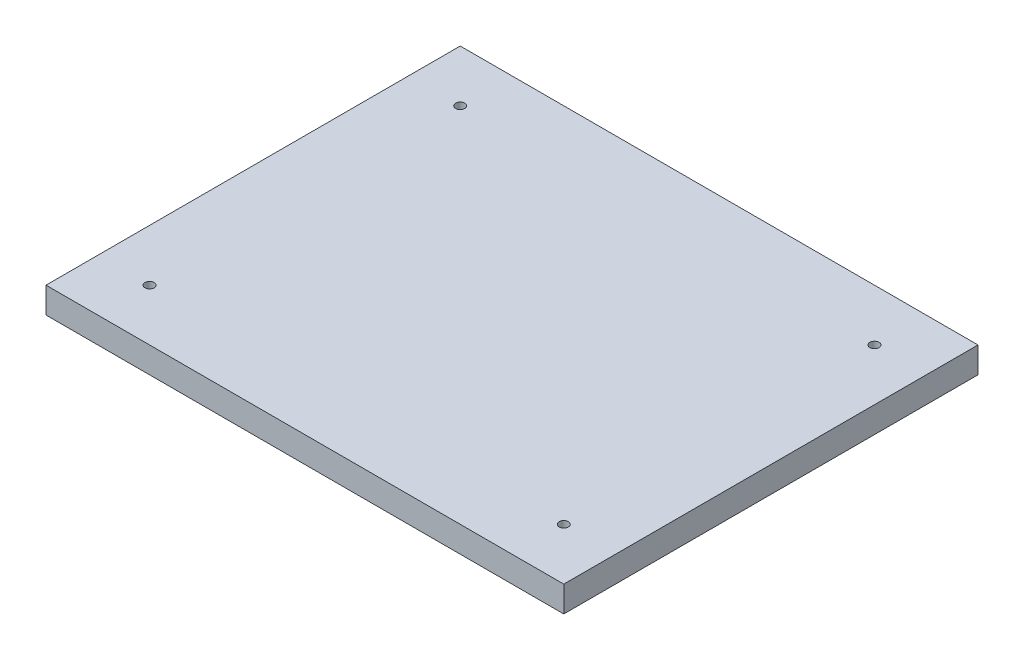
from build123d import *

# Parameters (mm, degrees)
SKETCH1_W                 = 127
SKETCH1_H                 = 101.6
EXTRUDE1_DEPTH            = 6.35
F_4_40_TAPPED_HOLE1_D     = 2.2606
F_4_40_TAPPED_HOLE1_DEPTH = 7.62
F_4_40_TAPPED_HOLE1_TIP   = 0.679152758


with BuildPart() as part:
    # Sketch1 → Extrude1 (new body)
    with BuildSketch(Plane(origin=(0, 0, 0), x_dir=(1, 0, 0), z_dir=(0, 1, 0))):
        with Locations((30.905893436, -21.924918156)):
            Rectangle(SKETCH1_W, SKETCH1_H)
    extrude(amount=EXTRUDE1_DEPTH)

    # 4-40 Tapped Hole1
    with Locations(Plane(origin=(0, 6.35, 0), x_dir=(-1, 0, 0), z_dir=(0, 1, 0))):
        with Locations((19.894106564, 60.024918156), (19.894106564, -16.175081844), (-81.705893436, -16.175081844), (-81.705893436, 60.024918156)):
            Hole(F_4_40_TAPPED_HOLE1_D / 2, depth=F_4_40_TAPPED_HOLE1_DEPTH)
            with Locations((0, 0, -(F_4_40_TAPPED_HOLE1_DEPTH + F_4_40_TAPPED_HOLE1_TIP / 2))):  # 118° drill point
                Cone(0, F_4_40_TAPPED_HOLE1_D / 2, F_4_40_TAPPED_HOLE1_TIP, mode=Mode.SUBTRACT)


solid = part.part
